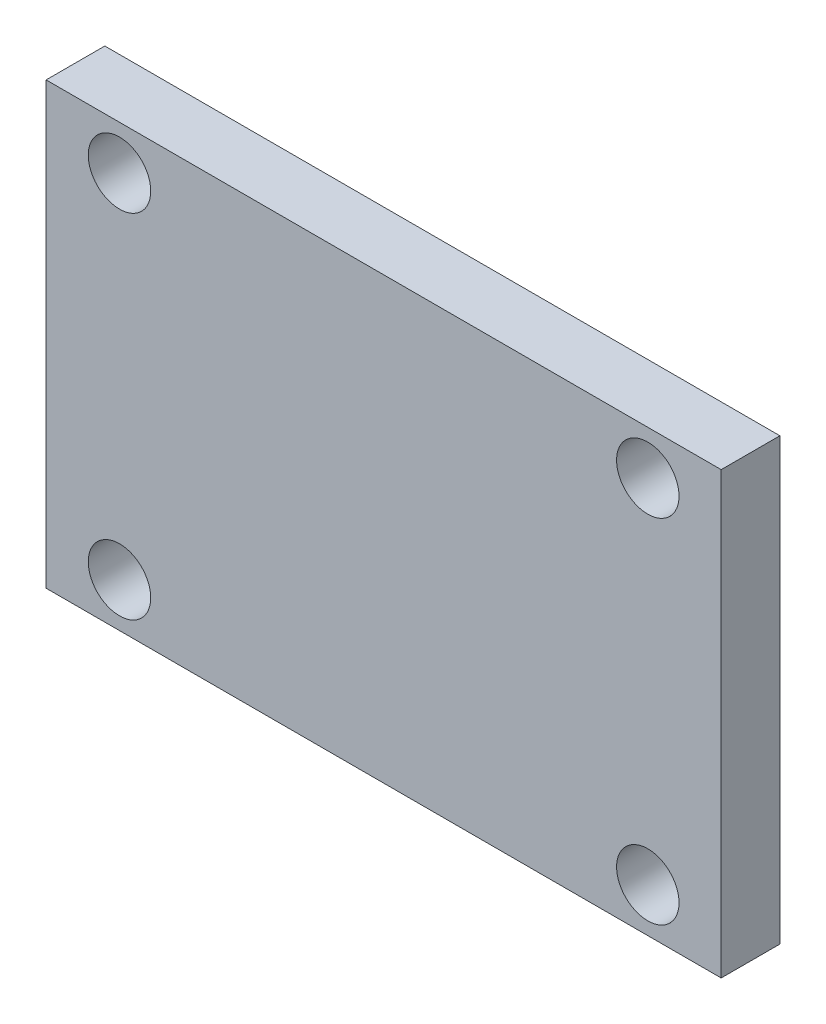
ISO-10303-21;
HEADER;
FILE_DESCRIPTION(('STEP AP214'),'2;1');
FILE_NAME('part.step','',(''),(''),'','','');
FILE_SCHEMA(('AUTOMOTIVE_DESIGN { 1 0 10303 214 1 1 1 1 }'));
ENDSEC;
DATA;
#1=APPLICATION_CONTEXT('core data for automotive mechanical design processes');
#2=APPLICATION_PROTOCOL_DEFINITION('international standard','automotive_design',2000,#1);
#3=PRODUCT_CONTEXT('',#1,'mechanical');
#4=PRODUCT('Part','Part','',(#3));
#5=PRODUCT_RELATED_PRODUCT_CATEGORY('part','',(#4));
#6=PRODUCT_DEFINITION_FORMATION('','',#4);
#7=PRODUCT_DEFINITION_CONTEXT('part definition',#1,'design');
#8=PRODUCT_DEFINITION('design','',#6,#7);
#9=PRODUCT_DEFINITION_SHAPE('','',#8);
#10=(LENGTH_UNIT() NAMED_UNIT(*) SI_UNIT(.MILLI.,.METRE.));
#11=(NAMED_UNIT(*) PLANE_ANGLE_UNIT() SI_UNIT($,.RADIAN.));
#12=(NAMED_UNIT(*) SI_UNIT($,.STERADIAN.) SOLID_ANGLE_UNIT());
#13=UNCERTAINTY_MEASURE_WITH_UNIT(LENGTH_MEASURE(1.E-05),#10,'distance_accuracy_value','');
#14=(GEOMETRIC_REPRESENTATION_CONTEXT(3) GLOBAL_UNCERTAINTY_ASSIGNED_CONTEXT((#13)) GLOBAL_UNIT_ASSIGNED_CONTEXT((#10,
#11,#12)) REPRESENTATION_CONTEXT('',''));
#15=CARTESIAN_POINT('',(0.,0.,0.));
#16=DIRECTION('',(0.,0.,1.));
#17=DIRECTION('',(1.,0.,0.));
#18=AXIS2_PLACEMENT_3D('',#15,#16,#17);
#19=CARTESIAN_POINT('',(0.,0.,6.35));
#20=DIRECTION('',(1.,0.,0.));
#21=DIRECTION('',(0.,0.,-1.));
#22=AXIS2_PLACEMENT_3D('',#19,#20,#21);
#23=PLANE('',#22);
#24=DIRECTION('',(0.,-1.,0.));
#25=VECTOR('',#24,1.);
#26=CARTESIAN_POINT('',(0.,0.,0.));
#27=LINE('',#26,#25);
#28=CARTESIAN_POINT('',(0.,47.625,0.));
#29=VERTEX_POINT('',#28);
#30=CARTESIAN_POINT('',(0.,0.,0.));
#31=VERTEX_POINT('',#30);
#32=EDGE_CURVE('E93',#29,#31,#27,.T.);
#33=ORIENTED_EDGE('',*,*,#32,.T.);
#34=DIRECTION('',(0.,0.,-1.));
#35=VECTOR('',#34,1.);
#36=CARTESIAN_POINT('',(0.,0.,6.35));
#37=LINE('',#36,#35);
#38=CARTESIAN_POINT('',(0.,0.,6.35));
#39=VERTEX_POINT('',#38);
#40=EDGE_CURVE('E11',#39,#31,#37,.T.);
#41=ORIENTED_EDGE('',*,*,#40,.F.);
#42=DIRECTION('',(0.,-1.,0.));
#43=VECTOR('',#42,1.);
#44=CARTESIAN_POINT('',(0.,0.,6.35));
#45=LINE('',#44,#43);
#46=CARTESIAN_POINT('',(0.,47.625,6.35));
#47=VERTEX_POINT('',#46);
#48=EDGE_CURVE('E81',#47,#39,#45,.T.);
#49=ORIENTED_EDGE('',*,*,#48,.F.);
#50=DIRECTION('',(0.,0.,-1.));
#51=VECTOR('',#50,1.);
#52=CARTESIAN_POINT('',(0.,47.625,6.35));
#53=LINE('',#52,#51);
#54=EDGE_CURVE('E89',#47,#29,#53,.T.);
#55=ORIENTED_EDGE('',*,*,#54,.T.);
#56=EDGE_LOOP('',(#33,#41,#49,#55));
#57=FACE_BOUND('',#56,.T.);
#58=ADVANCED_FACE('F30',(#57),#23,.F.);
#59=CARTESIAN_POINT('',(0.,0.,6.35));
#60=DIRECTION('',(0.,1.,0.));
#61=DIRECTION('',(0.,0.,1.));
#62=AXIS2_PLACEMENT_3D('',#59,#60,#61);
#63=PLANE('',#62);
#64=DIRECTION('',(1.,0.,0.));
#65=VECTOR('',#64,1.);
#66=CARTESIAN_POINT('',(0.,0.,0.));
#67=LINE('',#66,#65);
#68=CARTESIAN_POINT('',(73.025,0.,0.));
#69=VERTEX_POINT('',#68);
#70=EDGE_CURVE('E85',#31,#69,#67,.T.);
#71=ORIENTED_EDGE('',*,*,#70,.T.);
#72=DIRECTION('',(0.,0.,-1.));
#73=VECTOR('',#72,1.);
#74=CARTESIAN_POINT('',(73.025,0.,6.35));
#75=LINE('',#74,#73);
#76=CARTESIAN_POINT('',(73.025,0.,6.35));
#77=VERTEX_POINT('',#76);
#78=EDGE_CURVE('E38',#77,#69,#75,.T.);
#79=ORIENTED_EDGE('',*,*,#78,.F.);
#80=DIRECTION('',(1.,0.,0.));
#81=VECTOR('',#80,1.);
#82=CARTESIAN_POINT('',(0.,0.,6.35));
#83=LINE('',#82,#81);
#84=EDGE_CURVE('E76',#39,#77,#83,.T.);
#85=ORIENTED_EDGE('',*,*,#84,.F.);
#86=ORIENTED_EDGE('',*,*,#40,.T.);
#87=EDGE_LOOP('',(#71,#79,#85,#86));
#88=FACE_BOUND('',#87,.T.);
#89=ADVANCED_FACE('F84',(#88),#63,.F.);
#90=CARTESIAN_POINT('',(73.025,0.,6.35));
#91=DIRECTION('',(-1.,0.,0.));
#92=DIRECTION('',(0.,0.,1.));
#93=AXIS2_PLACEMENT_3D('',#90,#91,#92);
#94=PLANE('',#93);
#95=DIRECTION('',(0.,1.,0.));
#96=VECTOR('',#95,1.);
#97=CARTESIAN_POINT('',(73.025,0.,0.));
#98=LINE('',#97,#96);
#99=CARTESIAN_POINT('',(73.025,47.625,0.));
#100=VERTEX_POINT('',#99);
#101=EDGE_CURVE('E63',#69,#100,#98,.T.);
#102=ORIENTED_EDGE('',*,*,#101,.T.);
#103=DIRECTION('',(0.,0.,-1.));
#104=VECTOR('',#103,1.);
#105=CARTESIAN_POINT('',(73.025,47.625,6.35));
#106=LINE('',#105,#104);
#107=CARTESIAN_POINT('',(73.025,47.625,6.35));
#108=VERTEX_POINT('',#107);
#109=EDGE_CURVE('E86',#108,#100,#106,.T.);
#110=ORIENTED_EDGE('',*,*,#109,.F.);
#111=DIRECTION('',(0.,1.,0.));
#112=VECTOR('',#111,1.);
#113=CARTESIAN_POINT('',(73.025,0.,6.35));
#114=LINE('',#113,#112);
#115=EDGE_CURVE('E79',#77,#108,#114,.T.);
#116=ORIENTED_EDGE('',*,*,#115,.F.);
#117=ORIENTED_EDGE('',*,*,#78,.T.);
#118=EDGE_LOOP('',(#102,#110,#116,#117));
#119=FACE_BOUND('',#118,.T.);
#120=ADVANCED_FACE('F87',(#119),#94,.F.);
#121=CARTESIAN_POINT('',(0.,47.625,6.35));
#122=DIRECTION('',(0.,-1.,0.));
#123=DIRECTION('',(0.,0.,-1.));
#124=AXIS2_PLACEMENT_3D('',#121,#122,#123);
#125=PLANE('',#124);
#126=DIRECTION('',(-1.,0.,0.));
#127=VECTOR('',#126,1.);
#128=CARTESIAN_POINT('',(0.,47.625,0.));
#129=LINE('',#128,#127);
#130=EDGE_CURVE('E69',#100,#29,#129,.T.);
#131=ORIENTED_EDGE('',*,*,#130,.T.);
#132=ORIENTED_EDGE('',*,*,#54,.F.);
#133=DIRECTION('',(-1.,0.,0.));
#134=VECTOR('',#133,1.);
#135=CARTESIAN_POINT('',(0.,47.625,6.35));
#136=LINE('',#135,#134);
#137=EDGE_CURVE('E46',#108,#47,#136,.T.);
#138=ORIENTED_EDGE('',*,*,#137,.F.);
#139=ORIENTED_EDGE('',*,*,#109,.T.);
#140=EDGE_LOOP('',(#131,#132,#138,#139));
#141=FACE_BOUND('',#140,.T.);
#142=ADVANCED_FACE('F101',(#141),#125,.F.);
#143=CARTESIAN_POINT('',(0.,47.625,6.35));
#144=DIRECTION('',(0.,0.,-1.));
#145=DIRECTION('',(-1.,0.,0.));
#146=AXIS2_PLACEMENT_3D('',#143,#144,#145);
#147=PLANE('',#146);
#148=CARTESIAN_POINT('',(7.93749999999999,42.8625,6.35));
#149=DIRECTION('',(0.,0.,1.));
#150=DIRECTION('',(1.,0.,0.));
#151=AXIS2_PLACEMENT_3D('',#148,#149,#150);
#152=CIRCLE('',#151,3.37819999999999);
#153=CARTESIAN_POINT('',(11.3157,42.8625,6.35));
#154=VERTEX_POINT('',#153);
#155=EDGE_CURVE('E127',#154,#154,#152,.T.);
#156=ORIENTED_EDGE('',*,*,#155,.F.);
#157=EDGE_LOOP('',(#156));
#158=FACE_BOUND('',#157,.T.);
#159=CARTESIAN_POINT('',(65.0875,42.8625,6.35));
#160=DIRECTION('',(0.,0.,1.));
#161=DIRECTION('',(1.,0.,0.));
#162=AXIS2_PLACEMENT_3D('',#159,#160,#161);
#163=CIRCLE('',#162,3.37819999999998);
#164=CARTESIAN_POINT('',(68.4657,42.8625,6.35));
#165=VERTEX_POINT('',#164);
#166=EDGE_CURVE('E121',#165,#165,#163,.T.);
#167=ORIENTED_EDGE('',*,*,#166,.F.);
#168=EDGE_LOOP('',(#167));
#169=FACE_BOUND('',#168,.T.);
#170=CARTESIAN_POINT('',(65.0875,4.7625,6.35));
#171=DIRECTION('',(0.,0.,1.));
#172=DIRECTION('',(1.,0.,0.));
#173=AXIS2_PLACEMENT_3D('',#170,#171,#172);
#174=CIRCLE('',#173,3.37819999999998);
#175=CARTESIAN_POINT('',(68.4657,4.7625,6.35));
#176=VERTEX_POINT('',#175);
#177=EDGE_CURVE('E115',#176,#176,#174,.T.);
#178=ORIENTED_EDGE('',*,*,#177,.F.);
#179=EDGE_LOOP('',(#178));
#180=FACE_BOUND('',#179,.T.);
#181=CARTESIAN_POINT('',(7.93749999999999,4.7625,6.35));
#182=DIRECTION('',(0.,0.,1.));
#183=DIRECTION('',(1.,0.,0.));
#184=AXIS2_PLACEMENT_3D('',#181,#182,#183);
#185=CIRCLE('',#184,3.37819999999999);
#186=CARTESIAN_POINT('',(11.3157,4.7625,6.35));
#187=VERTEX_POINT('',#186);
#188=EDGE_CURVE('E109',#187,#187,#185,.T.);
#189=ORIENTED_EDGE('',*,*,#188,.F.);
#190=EDGE_LOOP('',(#189));
#191=FACE_BOUND('',#190,.T.);
#192=ORIENTED_EDGE('',*,*,#48,.T.);
#193=ORIENTED_EDGE('',*,*,#84,.T.);
#194=ORIENTED_EDGE('',*,*,#115,.T.);
#195=ORIENTED_EDGE('',*,*,#137,.T.);
#196=EDGE_LOOP('',(#192,#193,#194,#195));
#197=FACE_BOUND('',#196,.T.);
#198=ADVANCED_FACE('F77',(#158,#169,#180,#191,#197),#147,.F.);
#199=CARTESIAN_POINT('',(0.,47.625,0.));
#200=DIRECTION('',(0.,0.,-1.));
#201=DIRECTION('',(-1.,0.,0.));
#202=AXIS2_PLACEMENT_3D('',#199,#200,#201);
#203=PLANE('',#202);
#204=CARTESIAN_POINT('',(7.93749999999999,42.8625,0.));
#205=DIRECTION('',(0.,0.,1.));
#206=DIRECTION('',(1.,0.,0.));
#207=AXIS2_PLACEMENT_3D('',#204,#205,#206);
#208=CIRCLE('',#207,3.3782);
#209=CARTESIAN_POINT('',(11.3157,42.8625,0.));
#210=VERTEX_POINT('',#209);
#211=EDGE_CURVE('E124',#210,#210,#208,.T.);
#212=ORIENTED_EDGE('',*,*,#211,.T.);
#213=EDGE_LOOP('',(#212));
#214=FACE_BOUND('',#213,.T.);
#215=CARTESIAN_POINT('',(65.0875,42.8625,0.));
#216=DIRECTION('',(0.,0.,1.));
#217=DIRECTION('',(1.,0.,0.));
#218=AXIS2_PLACEMENT_3D('',#215,#216,#217);
#219=CIRCLE('',#218,3.3782);
#220=CARTESIAN_POINT('',(68.4657,42.8625,0.));
#221=VERTEX_POINT('',#220);
#222=EDGE_CURVE('E118',#221,#221,#219,.T.);
#223=ORIENTED_EDGE('',*,*,#222,.T.);
#224=EDGE_LOOP('',(#223));
#225=FACE_BOUND('',#224,.T.);
#226=CARTESIAN_POINT('',(65.0875,4.7625,0.));
#227=DIRECTION('',(0.,0.,1.));
#228=DIRECTION('',(1.,0.,0.));
#229=AXIS2_PLACEMENT_3D('',#226,#227,#228);
#230=CIRCLE('',#229,3.3782);
#231=CARTESIAN_POINT('',(68.4657,4.7625,0.));
#232=VERTEX_POINT('',#231);
#233=EDGE_CURVE('E112',#232,#232,#230,.T.);
#234=ORIENTED_EDGE('',*,*,#233,.T.);
#235=EDGE_LOOP('',(#234));
#236=FACE_BOUND('',#235,.T.);
#237=CARTESIAN_POINT('',(7.93749999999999,4.7625,0.));
#238=DIRECTION('',(0.,0.,1.));
#239=DIRECTION('',(1.,0.,0.));
#240=AXIS2_PLACEMENT_3D('',#237,#238,#239);
#241=CIRCLE('',#240,3.3782);
#242=CARTESIAN_POINT('',(11.3157,4.7625,0.));
#243=VERTEX_POINT('',#242);
#244=EDGE_CURVE('E96',#243,#243,#241,.T.);
#245=ORIENTED_EDGE('',*,*,#244,.T.);
#246=EDGE_LOOP('',(#245));
#247=FACE_BOUND('',#246,.T.);
#248=ORIENTED_EDGE('',*,*,#32,.F.);
#249=ORIENTED_EDGE('',*,*,#130,.F.);
#250=ORIENTED_EDGE('',*,*,#101,.F.);
#251=ORIENTED_EDGE('',*,*,#70,.F.);
#252=EDGE_LOOP('',(#248,#249,#250,#251));
#253=FACE_BOUND('',#252,.T.);
#254=ADVANCED_FACE('F104',(#214,#225,#236,#247,#253),#203,.T.);
#255=CARTESIAN_POINT('',(7.93749999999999,4.7625,6.35));
#256=DIRECTION('',(0.,0.,1.));
#257=DIRECTION('',(1.,0.,0.));
#258=AXIS2_PLACEMENT_3D('',#255,#256,#257);
#259=CYLINDRICAL_SURFACE('',#258,3.37819999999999);
#260=ORIENTED_EDGE('',*,*,#244,.F.);
#261=EDGE_LOOP('',(#260));
#262=FACE_BOUND('',#261,.T.);
#263=ORIENTED_EDGE('',*,*,#188,.T.);
#264=EDGE_LOOP('',(#263));
#265=FACE_BOUND('',#264,.T.);
#266=ADVANCED_FACE('F142',(#262,#265),#259,.F.);
#267=CARTESIAN_POINT('',(65.0875,4.7625,6.35));
#268=DIRECTION('',(0.,0.,1.));
#269=DIRECTION('',(1.,0.,0.));
#270=AXIS2_PLACEMENT_3D('',#267,#268,#269);
#271=CYLINDRICAL_SURFACE('',#270,3.37819999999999);
#272=ORIENTED_EDGE('',*,*,#233,.F.);
#273=EDGE_LOOP('',(#272));
#274=FACE_BOUND('',#273,.T.);
#275=ORIENTED_EDGE('',*,*,#177,.T.);
#276=EDGE_LOOP('',(#275));
#277=FACE_BOUND('',#276,.T.);
#278=ADVANCED_FACE('F144',(#274,#277),#271,.F.);
#279=CARTESIAN_POINT('',(65.0875,42.8625,6.35));
#280=DIRECTION('',(0.,0.,1.));
#281=DIRECTION('',(1.,0.,0.));
#282=AXIS2_PLACEMENT_3D('',#279,#280,#281);
#283=CYLINDRICAL_SURFACE('',#282,3.37819999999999);
#284=ORIENTED_EDGE('',*,*,#222,.F.);
#285=EDGE_LOOP('',(#284));
#286=FACE_BOUND('',#285,.T.);
#287=ORIENTED_EDGE('',*,*,#166,.T.);
#288=EDGE_LOOP('',(#287));
#289=FACE_BOUND('',#288,.T.);
#290=ADVANCED_FACE('F151',(#286,#289),#283,.F.);
#291=CARTESIAN_POINT('',(7.93749999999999,42.8625,6.35));
#292=DIRECTION('',(0.,0.,1.));
#293=DIRECTION('',(1.,0.,0.));
#294=AXIS2_PLACEMENT_3D('',#291,#292,#293);
#295=CYLINDRICAL_SURFACE('',#294,3.37819999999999);
#296=ORIENTED_EDGE('',*,*,#211,.F.);
#297=EDGE_LOOP('',(#296));
#298=FACE_BOUND('',#297,.T.);
#299=ORIENTED_EDGE('',*,*,#155,.T.);
#300=EDGE_LOOP('',(#299));
#301=FACE_BOUND('',#300,.T.);
#302=ADVANCED_FACE('F131',(#298,#301),#295,.F.);
#303=CLOSED_SHELL('',(#58,#89,#120,#142,#198,#254,#266,#278,#290,#302));
#304=MANIFOLD_SOLID_BREP('B2',#303);
#305=ADVANCED_BREP_SHAPE_REPRESENTATION('',(#18,#304),#14);
#306=SHAPE_DEFINITION_REPRESENTATION(#9,#305);
ENDSEC;
END-ISO-10303-21;
